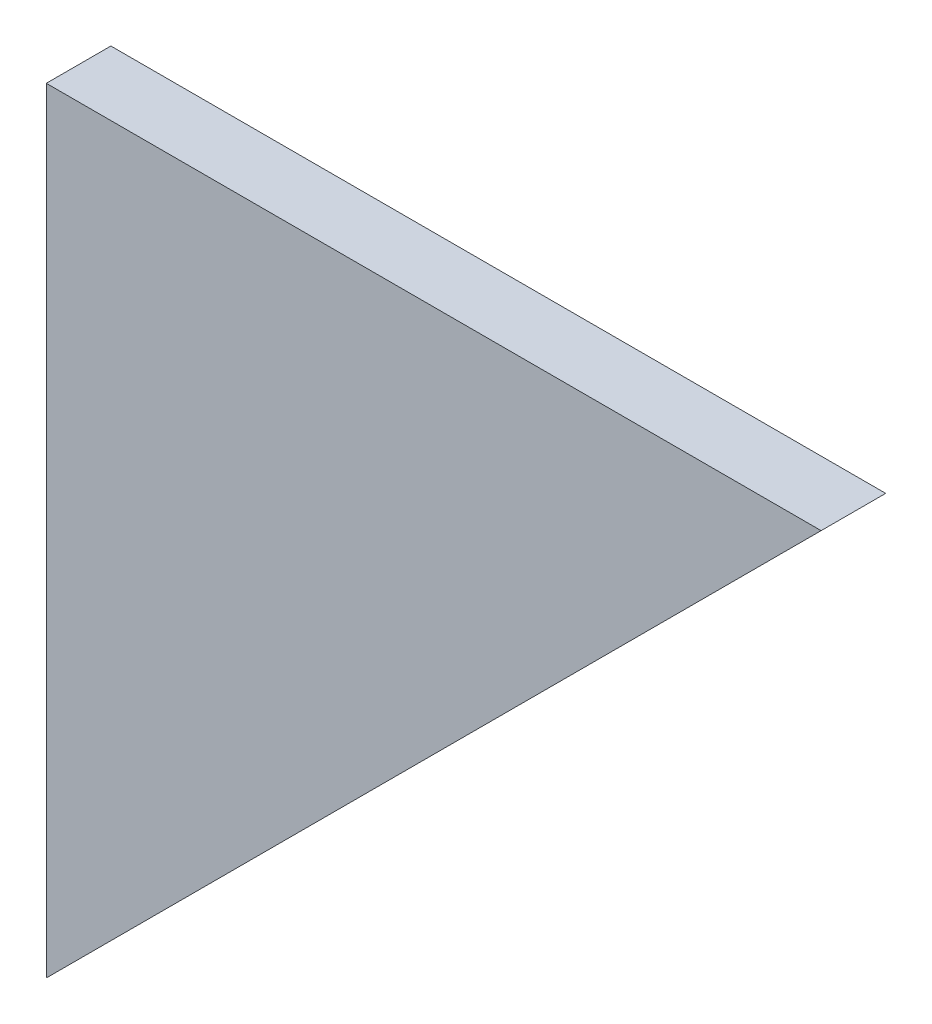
from build123d import *

# Parameters (mm, degrees)
SKETCH3_W      = 76.2
SKETCH3_H      = 76.2
EXTRUDE1_DEPTH = 3.175
EXTRUDE2_DEPTH = 55.254423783


with BuildPart() as part:
    # Sketch3 → Extrude1 (new, symmetric)
    with BuildSketch(Plane.XY):
        Rectangle(SKETCH3_W, SKETCH3_H)
    extrude(amount=EXTRUDE1_DEPTH, both=True)

    # Sketch4 → Extrude2 (cut, through all)
    with BuildSketch(Plane.XY.offset(3.175)):
        Polygon((-38.1, -38.1), (38.1, 38.1), (38.1, -38.1), align=None)
    extrude(amount=-EXTRUDE2_DEPTH, mode=Mode.SUBTRACT)


solid = part.part
